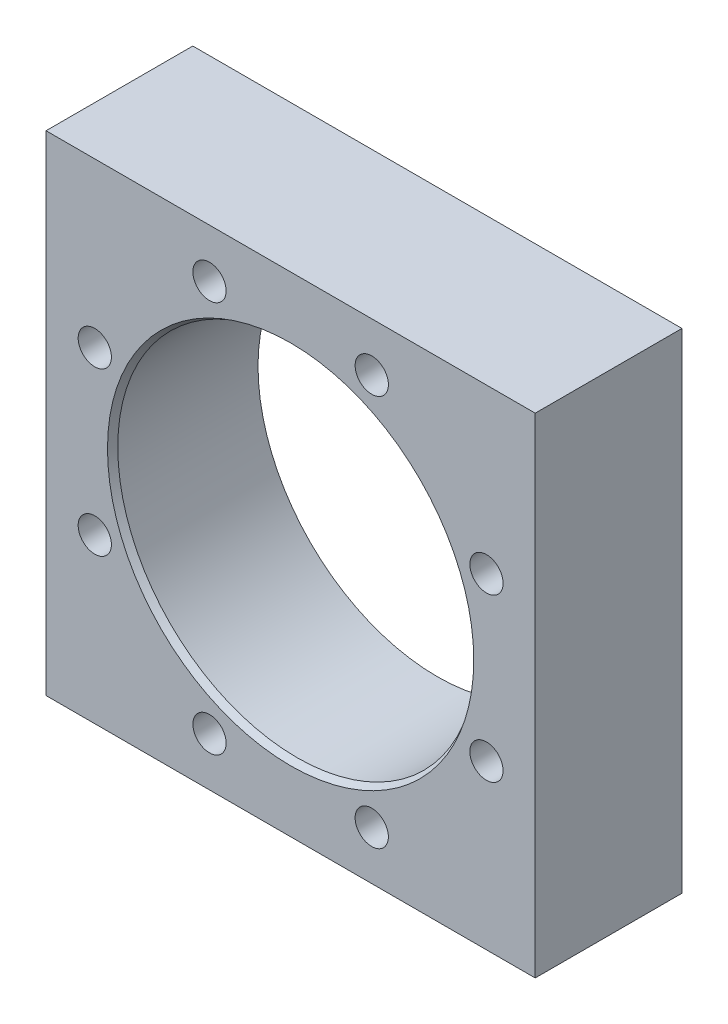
ISO-10303-21;
HEADER;
FILE_DESCRIPTION(('STEP AP214'),'2;1');
FILE_NAME('part.step','',(''),(''),'','','');
FILE_SCHEMA(('AUTOMOTIVE_DESIGN { 1 0 10303 214 1 1 1 1 }'));
ENDSEC;
DATA;
#1=APPLICATION_CONTEXT('core data for automotive mechanical design processes');
#2=APPLICATION_PROTOCOL_DEFINITION('international standard','automotive_design',2000,#1);
#3=PRODUCT_CONTEXT('',#1,'mechanical');
#4=PRODUCT('Part','Part','',(#3));
#5=PRODUCT_RELATED_PRODUCT_CATEGORY('part','',(#4));
#6=PRODUCT_DEFINITION_FORMATION('','',#4);
#7=PRODUCT_DEFINITION_CONTEXT('part definition',#1,'design');
#8=PRODUCT_DEFINITION('design','',#6,#7);
#9=PRODUCT_DEFINITION_SHAPE('','',#8);
#10=(LENGTH_UNIT() NAMED_UNIT(*) SI_UNIT(.MILLI.,.METRE.));
#11=(NAMED_UNIT(*) PLANE_ANGLE_UNIT() SI_UNIT($,.RADIAN.));
#12=(NAMED_UNIT(*) SI_UNIT($,.STERADIAN.) SOLID_ANGLE_UNIT());
#13=UNCERTAINTY_MEASURE_WITH_UNIT(LENGTH_MEASURE(1.E-05),#10,'distance_accuracy_value','');
#14=(GEOMETRIC_REPRESENTATION_CONTEXT(3) GLOBAL_UNCERTAINTY_ASSIGNED_CONTEXT((#13)) GLOBAL_UNIT_ASSIGNED_CONTEXT((#10,
#11,#12)) REPRESENTATION_CONTEXT('',''));
#15=CARTESIAN_POINT('',(0.,0.,0.));
#16=DIRECTION('',(0.,0.,1.));
#17=DIRECTION('',(1.,0.,0.));
#18=AXIS2_PLACEMENT_3D('',#15,#16,#17);
#19=CARTESIAN_POINT('',(0.,150.,45.));
#20=DIRECTION('',(0.,0.,-1.));
#21=DIRECTION('',(-1.,0.,0.));
#22=AXIS2_PLACEMENT_3D('',#19,#20,#21);
#23=PLANE('',#22);
#24=CARTESIAN_POINT('',(75.,75.,45.));
#25=DIRECTION('',(0.,0.,-1.));
#26=DIRECTION('',(-1.,0.,0.));
#27=AXIS2_PLACEMENT_3D('',#24,#25,#26);
#28=CIRCLE('',#27,56.1547005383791);
#29=CARTESIAN_POINT('',(18.8452994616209,75.,45.));
#30=VERTEX_POINT('',#29);
#31=EDGE_CURVE('E11',#30,#30,#28,.T.);
#32=ORIENTED_EDGE('',*,*,#31,.T.);
#33=EDGE_LOOP('',(#32));
#34=FACE_BOUND('',#33,.T.);
#35=CARTESIAN_POINT('',(50.1255768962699,135.052169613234,45.));
#36=DIRECTION('',(0.,0.,1.));
#37=DIRECTION('',(1.,0.,0.));
#38=AXIS2_PLACEMENT_3D('',#35,#36,#37);
#39=CIRCLE('',#38,5.09999999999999);
#40=CARTESIAN_POINT('',(55.2255768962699,135.052169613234,45.));
#41=VERTEX_POINT('',#40);
#42=EDGE_CURVE('E108',#41,#41,#39,.T.);
#43=ORIENTED_EDGE('',*,*,#42,.F.);
#44=EDGE_LOOP('',(#43));
#45=FACE_BOUND('',#44,.T.);
#46=CARTESIAN_POINT('',(14.9478303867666,99.8744231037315,45.));
#47=DIRECTION('',(0.,0.,1.));
#48=DIRECTION('',(1.,0.,0.));
#49=AXIS2_PLACEMENT_3D('',#46,#47,#48);
#50=CIRCLE('',#49,5.09999999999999);
#51=CARTESIAN_POINT('',(20.0478303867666,99.8744231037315,45.));
#52=VERTEX_POINT('',#51);
#53=EDGE_CURVE('E116',#52,#52,#50,.T.);
#54=ORIENTED_EDGE('',*,*,#53,.F.);
#55=EDGE_LOOP('',(#54));
#56=FACE_BOUND('',#55,.T.);
#57=CARTESIAN_POINT('',(14.9478303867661,50.1255768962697,45.));
#58=DIRECTION('',(0.,0.,1.));
#59=DIRECTION('',(1.,0.,0.));
#60=AXIS2_PLACEMENT_3D('',#57,#58,#59);
#61=CIRCLE('',#60,5.09999999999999);
#62=CARTESIAN_POINT('',(20.047830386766,50.1255768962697,45.));
#63=VERTEX_POINT('',#62);
#64=EDGE_CURVE('E122',#63,#63,#61,.T.);
#65=ORIENTED_EDGE('',*,*,#64,.F.);
#66=EDGE_LOOP('',(#65));
#67=FACE_BOUND('',#66,.T.);
#68=CARTESIAN_POINT('',(50.1255768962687,14.9478303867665,45.));
#69=DIRECTION('',(0.,0.,1.));
#70=DIRECTION('',(1.,0.,0.));
#71=AXIS2_PLACEMENT_3D('',#68,#69,#70);
#72=CIRCLE('',#71,5.09999999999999);
#73=CARTESIAN_POINT('',(55.2255768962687,14.9478303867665,45.));
#74=VERTEX_POINT('',#73);
#75=EDGE_CURVE('E128',#74,#74,#72,.T.);
#76=ORIENTED_EDGE('',*,*,#75,.F.);
#77=EDGE_LOOP('',(#76));
#78=FACE_BOUND('',#77,.T.);
#79=CARTESIAN_POINT('',(99.8744231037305,14.9478303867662,45.));
#80=DIRECTION('',(0.,0.,1.));
#81=DIRECTION('',(1.,0.,0.));
#82=AXIS2_PLACEMENT_3D('',#79,#80,#81);
#83=CIRCLE('',#82,5.09999999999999);
#84=CARTESIAN_POINT('',(104.97442310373,14.9478303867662,45.));
#85=VERTEX_POINT('',#84);
#86=EDGE_CURVE('E134',#85,#85,#83,.T.);
#87=ORIENTED_EDGE('',*,*,#86,.F.);
#88=EDGE_LOOP('',(#87));
#89=FACE_BOUND('',#88,.T.);
#90=CARTESIAN_POINT('',(135.052169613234,50.1255768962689,45.));
#91=DIRECTION('',(0.,0.,1.));
#92=DIRECTION('',(1.,0.,0.));
#93=AXIS2_PLACEMENT_3D('',#90,#91,#92);
#94=CIRCLE('',#93,5.09999999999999);
#95=CARTESIAN_POINT('',(140.152169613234,50.1255768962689,45.));
#96=VERTEX_POINT('',#95);
#97=EDGE_CURVE('E140',#96,#96,#94,.T.);
#98=ORIENTED_EDGE('',*,*,#97,.F.);
#99=EDGE_LOOP('',(#98));
#100=FACE_BOUND('',#99,.T.);
#101=CARTESIAN_POINT('',(135.052169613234,99.8744231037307,45.));
#102=DIRECTION('',(0.,0.,1.));
#103=DIRECTION('',(1.,0.,0.));
#104=AXIS2_PLACEMENT_3D('',#101,#102,#103);
#105=CIRCLE('',#104,5.09999999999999);
#106=CARTESIAN_POINT('',(140.152169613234,99.8744231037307,45.));
#107=VERTEX_POINT('',#106);
#108=EDGE_CURVE('E146',#107,#107,#105,.T.);
#109=ORIENTED_EDGE('',*,*,#108,.F.);
#110=EDGE_LOOP('',(#109));
#111=FACE_BOUND('',#110,.T.);
#112=CARTESIAN_POINT('',(99.8744231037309,135.052169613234,45.));
#113=DIRECTION('',(0.,0.,1.));
#114=DIRECTION('',(1.,0.,0.));
#115=AXIS2_PLACEMENT_3D('',#112,#113,#114);
#116=CIRCLE('',#115,5.09999999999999);
#117=CARTESIAN_POINT('',(104.974423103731,135.052169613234,45.));
#118=VERTEX_POINT('',#117);
#119=EDGE_CURVE('E152',#118,#118,#116,.T.);
#120=ORIENTED_EDGE('',*,*,#119,.F.);
#121=EDGE_LOOP('',(#120));
#122=FACE_BOUND('',#121,.T.);
#123=DIRECTION('',(0.,-1.,0.));
#124=VECTOR('',#123,1.);
#125=CARTESIAN_POINT('',(0.,0.,45.));
#126=LINE('',#125,#124);
#127=CARTESIAN_POINT('',(0.,150.,45.));
#128=VERTEX_POINT('',#127);
#129=CARTESIAN_POINT('',(0.,0.,45.));
#130=VERTEX_POINT('',#129);
#131=EDGE_CURVE('E167',#128,#130,#126,.T.);
#132=ORIENTED_EDGE('',*,*,#131,.T.);
#133=DIRECTION('',(1.,0.,0.));
#134=VECTOR('',#133,1.);
#135=CARTESIAN_POINT('',(0.,0.,45.));
#136=LINE('',#135,#134);
#137=CARTESIAN_POINT('',(150.,0.,45.));
#138=VERTEX_POINT('',#137);
#139=EDGE_CURVE('E169',#130,#138,#136,.T.);
#140=ORIENTED_EDGE('',*,*,#139,.T.);
#141=DIRECTION('',(0.,1.,0.));
#142=VECTOR('',#141,1.);
#143=CARTESIAN_POINT('',(150.,0.,45.));
#144=LINE('',#143,#142);
#145=CARTESIAN_POINT('',(150.,150.,45.));
#146=VERTEX_POINT('',#145);
#147=EDGE_CURVE('E55',#138,#146,#144,.T.);
#148=ORIENTED_EDGE('',*,*,#147,.T.);
#149=DIRECTION('',(-1.,0.,0.));
#150=VECTOR('',#149,1.);
#151=CARTESIAN_POINT('',(0.,150.,45.));
#152=LINE('',#151,#150);
#153=EDGE_CURVE('E50',#146,#128,#152,.T.);
#154=ORIENTED_EDGE('',*,*,#153,.T.);
#155=EDGE_LOOP('',(#132,#140,#148,#154));
#156=FACE_BOUND('',#155,.T.);
#157=ADVANCED_FACE('F35',(#34,#45,#56,#67,#78,#89,#100,#111,#122,#156),#23,.F.);
#158=CARTESIAN_POINT('',(0.,150.,0.));
#159=DIRECTION('',(0.,0.,-1.));
#160=DIRECTION('',(-1.,0.,0.));
#161=AXIS2_PLACEMENT_3D('',#158,#159,#160);
#162=PLANE('',#161);
#163=DIRECTION('',(0.,-1.,0.));
#164=VECTOR('',#163,1.);
#165=CARTESIAN_POINT('',(0.,0.,0.));
#166=LINE('',#165,#164);
#167=CARTESIAN_POINT('',(0.,150.,0.));
#168=VERTEX_POINT('',#167);
#169=CARTESIAN_POINT('',(0.,0.,0.));
#170=VERTEX_POINT('',#169);
#171=EDGE_CURVE('E158',#168,#170,#166,.T.);
#172=ORIENTED_EDGE('',*,*,#171,.F.);
#173=DIRECTION('',(-1.,0.,0.));
#174=VECTOR('',#173,1.);
#175=CARTESIAN_POINT('',(0.,150.,0.));
#176=LINE('',#175,#174);
#177=CARTESIAN_POINT('',(150.,150.,0.));
#178=VERTEX_POINT('',#177);
#179=EDGE_CURVE('E165',#178,#168,#176,.T.);
#180=ORIENTED_EDGE('',*,*,#179,.F.);
#181=DIRECTION('',(0.,1.,0.));
#182=VECTOR('',#181,1.);
#183=CARTESIAN_POINT('',(150.,0.,0.));
#184=LINE('',#183,#182);
#185=CARTESIAN_POINT('',(150.,0.,0.));
#186=VERTEX_POINT('',#185);
#187=EDGE_CURVE('E163',#186,#178,#184,.T.);
#188=ORIENTED_EDGE('',*,*,#187,.F.);
#189=DIRECTION('',(1.,0.,0.));
#190=VECTOR('',#189,1.);
#191=CARTESIAN_POINT('',(0.,0.,0.));
#192=LINE('',#191,#190);
#193=EDGE_CURVE('E161',#170,#186,#192,.T.);
#194=ORIENTED_EDGE('',*,*,#193,.F.);
#195=EDGE_LOOP('',(#172,#180,#188,#194));
#196=FACE_BOUND('',#195,.T.);
#197=CARTESIAN_POINT('',(75.,75.,0.));
#198=DIRECTION('',(0.,0.,1.));
#199=DIRECTION('',(1.,0.,0.));
#200=AXIS2_PLACEMENT_3D('',#197,#198,#199);
#201=CIRCLE('',#200,55.);
#202=CARTESIAN_POINT('',(20.,75.,0.));
#203=VERTEX_POINT('',#202);
#204=EDGE_CURVE('E155',#203,#203,#201,.T.);
#205=ORIENTED_EDGE('',*,*,#204,.T.);
#206=EDGE_LOOP('',(#205));
#207=FACE_BOUND('',#206,.T.);
#208=ADVANCED_FACE('F197',(#196,#207),#162,.T.);
#209=CARTESIAN_POINT('',(0.,0.,45.));
#210=DIRECTION('',(1.,0.,0.));
#211=DIRECTION('',(0.,0.,-1.));
#212=AXIS2_PLACEMENT_3D('',#209,#210,#211);
#213=PLANE('',#212);
#214=ORIENTED_EDGE('',*,*,#171,.T.);
#215=DIRECTION('',(0.,0.,-1.));
#216=VECTOR('',#215,1.);
#217=CARTESIAN_POINT('',(0.,0.,45.));
#218=LINE('',#217,#216);
#219=EDGE_CURVE('E182',#130,#170,#218,.T.);
#220=ORIENTED_EDGE('',*,*,#219,.F.);
#221=ORIENTED_EDGE('',*,*,#131,.F.);
#222=DIRECTION('',(0.,0.,-1.));
#223=VECTOR('',#222,1.);
#224=CARTESIAN_POINT('',(0.,150.,45.));
#225=LINE('',#224,#223);
#226=EDGE_CURVE('E173',#128,#168,#225,.T.);
#227=ORIENTED_EDGE('',*,*,#226,.T.);
#228=EDGE_LOOP('',(#214,#220,#221,#227));
#229=FACE_BOUND('',#228,.T.);
#230=ADVANCED_FACE('F37',(#229),#213,.F.);
#231=CARTESIAN_POINT('',(0.,0.,45.));
#232=DIRECTION('',(0.,1.,0.));
#233=DIRECTION('',(0.,0.,1.));
#234=AXIS2_PLACEMENT_3D('',#231,#232,#233);
#235=PLANE('',#234);
#236=ORIENTED_EDGE('',*,*,#193,.T.);
#237=DIRECTION('',(0.,0.,-1.));
#238=VECTOR('',#237,1.);
#239=CARTESIAN_POINT('',(150.,0.,45.));
#240=LINE('',#239,#238);
#241=EDGE_CURVE('E179',#138,#186,#240,.T.);
#242=ORIENTED_EDGE('',*,*,#241,.F.);
#243=ORIENTED_EDGE('',*,*,#139,.F.);
#244=ORIENTED_EDGE('',*,*,#219,.T.);
#245=EDGE_LOOP('',(#236,#242,#243,#244));
#246=FACE_BOUND('',#245,.T.);
#247=ADVANCED_FACE('F214',(#246),#235,.F.);
#248=CARTESIAN_POINT('',(150.,0.,45.));
#249=DIRECTION('',(-1.,0.,0.));
#250=DIRECTION('',(0.,0.,1.));
#251=AXIS2_PLACEMENT_3D('',#248,#249,#250);
#252=PLANE('',#251);
#253=ORIENTED_EDGE('',*,*,#187,.T.);
#254=DIRECTION('',(0.,0.,-1.));
#255=VECTOR('',#254,1.);
#256=CARTESIAN_POINT('',(150.,150.,45.));
#257=LINE('',#256,#255);
#258=EDGE_CURVE('E176',#146,#178,#257,.T.);
#259=ORIENTED_EDGE('',*,*,#258,.F.);
#260=ORIENTED_EDGE('',*,*,#147,.F.);
#261=ORIENTED_EDGE('',*,*,#241,.T.);
#262=EDGE_LOOP('',(#253,#259,#260,#261));
#263=FACE_BOUND('',#262,.T.);
#264=ADVANCED_FACE('F211',(#263),#252,.F.);
#265=CARTESIAN_POINT('',(0.,150.,45.));
#266=DIRECTION('',(0.,-1.,0.));
#267=DIRECTION('',(0.,0.,-1.));
#268=AXIS2_PLACEMENT_3D('',#265,#266,#267);
#269=PLANE('',#268);
#270=ORIENTED_EDGE('',*,*,#179,.T.);
#271=ORIENTED_EDGE('',*,*,#226,.F.);
#272=ORIENTED_EDGE('',*,*,#153,.F.);
#273=ORIENTED_EDGE('',*,*,#258,.T.);
#274=EDGE_LOOP('',(#270,#271,#272,#273));
#275=FACE_BOUND('',#274,.T.);
#276=ADVANCED_FACE('F208',(#275),#269,.F.);
#277=CARTESIAN_POINT('',(75.,75.,45.));
#278=DIRECTION('',(0.,0.,-1.));
#279=DIRECTION('',(-1.,0.,0.));
#280=AXIS2_PLACEMENT_3D('',#277,#278,#279);
#281=CYLINDRICAL_SURFACE('',#280,55.);
#282=CARTESIAN_POINT('',(75.,75.,43.0000000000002));
#283=DIRECTION('',(0.,0.,-1.));
#284=DIRECTION('',(-1.,0.,0.));
#285=AXIS2_PLACEMENT_3D('',#282,#283,#284);
#286=CIRCLE('',#285,55.);
#287=CARTESIAN_POINT('',(20.,75.,43.0000000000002));
#288=VERTEX_POINT('',#287);
#289=EDGE_CURVE('E43',#288,#288,#286,.F.);
#290=CARTESIAN_POINT('',(20.,75.,43.0000000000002));
#291=CARTESIAN_POINT('',(20.,75.,42.5520833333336));
#292=CARTESIAN_POINT('',(20.,75.,42.1041666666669));
#293=CARTESIAN_POINT('',(20.,75.,41.2083333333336));
#294=CARTESIAN_POINT('',(20.,75.,40.7604166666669));
#295=CARTESIAN_POINT('',(20.,75.,39.8645833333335));
#296=CARTESIAN_POINT('',(20.,75.,39.4166666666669));
#297=CARTESIAN_POINT('',(20.,75.,38.5208333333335));
#298=CARTESIAN_POINT('',(20.,75.,38.0729166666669));
#299=CARTESIAN_POINT('',(20.,75.,37.1770833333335));
#300=CARTESIAN_POINT('',(20.,75.,36.7291666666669));
#301=CARTESIAN_POINT('',(20.,75.,35.8333333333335));
#302=CARTESIAN_POINT('',(20.,75.,35.3854166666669));
#303=CARTESIAN_POINT('',(20.,75.,34.4895833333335));
#304=CARTESIAN_POINT('',(20.,75.,34.0416666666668));
#305=CARTESIAN_POINT('',(20.,75.,33.1458333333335));
#306=CARTESIAN_POINT('',(20.,75.,32.6979166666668));
#307=CARTESIAN_POINT('',(20.,75.,31.8020833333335));
#308=CARTESIAN_POINT('',(20.,75.,31.3541666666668));
#309=CARTESIAN_POINT('',(20.,75.,30.4583333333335));
#310=CARTESIAN_POINT('',(20.,75.,30.0104166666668));
#311=CARTESIAN_POINT('',(20.,75.,29.1145833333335));
#312=CARTESIAN_POINT('',(20.,75.,28.6666666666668));
#313=CARTESIAN_POINT('',(20.,75.,27.7708333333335));
#314=CARTESIAN_POINT('',(20.,75.,27.3229166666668));
#315=CARTESIAN_POINT('',(20.,75.,26.4270833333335));
#316=CARTESIAN_POINT('',(20.,75.,25.9791666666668));
#317=CARTESIAN_POINT('',(20.,75.,25.0833333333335));
#318=CARTESIAN_POINT('',(20.,75.,24.6354166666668));
#319=CARTESIAN_POINT('',(20.,75.,23.7395833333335));
#320=CARTESIAN_POINT('',(20.,75.,23.2916666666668));
#321=CARTESIAN_POINT('',(20.,75.,22.3958333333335));
#322=CARTESIAN_POINT('',(20.,75.,21.9479166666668));
#323=CARTESIAN_POINT('',(20.,75.,21.0520833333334));
#324=CARTESIAN_POINT('',(20.,75.,20.6041666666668));
#325=CARTESIAN_POINT('',(20.,75.,19.7083333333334));
#326=CARTESIAN_POINT('',(20.,75.,19.2604166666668));
#327=CARTESIAN_POINT('',(20.,75.,18.3645833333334));
#328=CARTESIAN_POINT('',(20.,75.,17.9166666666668));
#329=CARTESIAN_POINT('',(20.,75.,17.0208333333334));
#330=CARTESIAN_POINT('',(20.,75.,16.5729166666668));
#331=CARTESIAN_POINT('',(20.,75.,15.6770833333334));
#332=CARTESIAN_POINT('',(20.,75.,15.2291666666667));
#333=CARTESIAN_POINT('',(20.,75.,14.3333333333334));
#334=CARTESIAN_POINT('',(20.,75.,13.8854166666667));
#335=CARTESIAN_POINT('',(20.,75.,12.9895833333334));
#336=CARTESIAN_POINT('',(20.,75.,12.5416666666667));
#337=CARTESIAN_POINT('',(20.,75.,11.6458333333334));
#338=CARTESIAN_POINT('',(20.,75.,11.1979166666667));
#339=CARTESIAN_POINT('',(20.,75.,10.3020833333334));
#340=CARTESIAN_POINT('',(20.,75.,9.85416666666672));
#341=CARTESIAN_POINT('',(20.,75.,8.95833333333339));
#342=CARTESIAN_POINT('',(20.,75.,8.51041666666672));
#343=CARTESIAN_POINT('',(20.,75.,7.61458333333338));
#344=CARTESIAN_POINT('',(20.,75.,7.1666666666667));
#345=CARTESIAN_POINT('',(20.,75.,6.27083333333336));
#346=CARTESIAN_POINT('',(20.,75.,5.82291666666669));
#347=CARTESIAN_POINT('',(20.,75.,4.92708333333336));
#348=CARTESIAN_POINT('',(20.,75.,4.47916666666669));
#349=CARTESIAN_POINT('',(20.,75.,3.58333333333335));
#350=CARTESIAN_POINT('',(20.,75.,3.13541666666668));
#351=CARTESIAN_POINT('',(20.,75.,2.23958333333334));
#352=CARTESIAN_POINT('',(20.,75.,1.79166666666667));
#353=CARTESIAN_POINT('',(20.,75.,0.895833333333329));
#354=CARTESIAN_POINT('',(20.,75.,0.447916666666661));
#355=CARTESIAN_POINT('',(20.,75.,0.));
#356=B_SPLINE_CURVE_WITH_KNOTS('',3,(#290,#291,#292,#293,#294,#295,#296,#297,#298,#299,#300,
#301,#302,#303,#304,#305,#306,#307,#308,#309,#310,#311,#312,#313,#314,#315,#316,#317,#318,#319,
#320,#321,#322,#323,#324,#325,#326,#327,#328,#329,#330,#331,#332,#333,#334,#335,#336,#337,#338,
#339,#340,#341,#342,#343,#344,#345,#346,#347,#348,#349,#350,#351,#352,#353,#354,#355),
.UNSPECIFIED.,.F.,.F.,(4,2,2,2,2,2,2,2,2,2,2,2,2,2,2,2,2,2,2,2,2,2,2,2,2,2,2,2,2,2,2,2,4),(0.,
1.34375000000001,2.68750000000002,4.03125000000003,5.37500000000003,6.71875000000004,
8.06250000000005,9.40625000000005,10.7500000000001,12.0937500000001,13.4375000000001,
14.7812500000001,16.1250000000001,17.4687500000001,18.8125000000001,20.1562500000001,
21.5000000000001,22.8437500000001,24.1875000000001,25.5312500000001,26.8750000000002,
28.2187500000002,29.5625000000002,30.9062500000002,32.2500000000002,33.5937500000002,
34.9375000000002,36.2812500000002,37.6250000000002,38.9687500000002,40.3125000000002,
41.6562500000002,43.0000000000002),.UNSPECIFIED.);
#357=EDGE_CURVE('BSEAM187',#288,#203,#356,.T.);
#358=ORIENTED_EDGE('',*,*,#289,.T.);
#359=ORIENTED_EDGE('',*,*,#204,.F.);
#360=ORIENTED_EDGE('',*,*,#357,.T.);
#361=ORIENTED_EDGE('',*,*,#357,.F.);
#362=EDGE_LOOP('',(#358,#360,#359,#361));
#363=FACE_BOUND('',#362,.T.);
#364=ADVANCED_FACE('F187',(#363),#281,.F.);
#365=CARTESIAN_POINT('',(99.8744231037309,135.052169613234,45.));
#366=DIRECTION('',(0.,0.,1.));
#367=DIRECTION('',(1.,0.,0.));
#368=AXIS2_PLACEMENT_3D('',#365,#366,#367);
#369=CYLINDRICAL_SURFACE('',#368,5.09999999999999);
#370=CARTESIAN_POINT('',(99.8744231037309,135.052169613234,9.99999999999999));
#371=DIRECTION('',(0.,0.,1.));
#372=DIRECTION('',(1.,0.,0.));
#373=AXIS2_PLACEMENT_3D('',#370,#371,#372);
#374=CIRCLE('',#373,5.09999999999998);
#375=CARTESIAN_POINT('',(104.974423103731,135.052169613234,9.99999999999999));
#376=VERTEX_POINT('',#375);
#377=EDGE_CURVE('E149',#376,#376,#374,.T.);
#378=ORIENTED_EDGE('',*,*,#377,.F.);
#379=EDGE_LOOP('',(#378));
#380=FACE_BOUND('',#379,.T.);
#381=ORIENTED_EDGE('',*,*,#119,.T.);
#382=EDGE_LOOP('',(#381));
#383=FACE_BOUND('',#382,.T.);
#384=ADVANCED_FACE('F231',(#380,#383),#369,.F.);
#385=CARTESIAN_POINT('',(99.8744231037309,135.052169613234,9.99999999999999));
#386=DIRECTION('',(0.,0.,1.));
#387=DIRECTION('',(1.,0.,0.));
#388=AXIS2_PLACEMENT_3D('',#385,#386,#387);
#389=CONICAL_SURFACE('',#388,5.09999999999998,1.02974425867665);
#390=CARTESIAN_POINT('',(99.8744231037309,135.052169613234,6.93561084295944));
#391=VERTEX_POINT('',#390);
#392=VERTEX_LOOP('',#391);
#393=FACE_BOUND('',#392,.T.);
#394=ORIENTED_EDGE('',*,*,#377,.T.);
#395=EDGE_LOOP('',(#394));
#396=FACE_BOUND('',#395,.T.);
#397=ADVANCED_FACE('F235',(#393,#396),#389,.F.);
#398=CARTESIAN_POINT('',(135.052169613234,99.8744231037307,45.));
#399=DIRECTION('',(0.,0.,1.));
#400=DIRECTION('',(1.,0.,0.));
#401=AXIS2_PLACEMENT_3D('',#398,#399,#400);
#402=CYLINDRICAL_SURFACE('',#401,5.09999999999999);
#403=CARTESIAN_POINT('',(135.052169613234,99.8744231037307,9.99999999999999));
#404=DIRECTION('',(0.,0.,1.));
#405=DIRECTION('',(1.,0.,0.));
#406=AXIS2_PLACEMENT_3D('',#403,#404,#405);
#407=CIRCLE('',#406,5.09999999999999);
#408=CARTESIAN_POINT('',(140.152169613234,99.8744231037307,9.99999999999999));
#409=VERTEX_POINT('',#408);
#410=EDGE_CURVE('E143',#409,#409,#407,.T.);
#411=ORIENTED_EDGE('',*,*,#410,.F.);
#412=EDGE_LOOP('',(#411));
#413=FACE_BOUND('',#412,.T.);
#414=ORIENTED_EDGE('',*,*,#108,.T.);
#415=EDGE_LOOP('',(#414));
#416=FACE_BOUND('',#415,.T.);
#417=ADVANCED_FACE('F241',(#413,#416),#402,.F.);
#418=CARTESIAN_POINT('',(135.052169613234,99.8744231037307,9.99999999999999));
#419=DIRECTION('',(0.,0.,1.));
#420=DIRECTION('',(1.,0.,0.));
#421=AXIS2_PLACEMENT_3D('',#418,#419,#420);
#422=CONICAL_SURFACE('',#421,5.09999999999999,1.02974425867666);
#423=CARTESIAN_POINT('',(135.052169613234,99.8744231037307,6.93561084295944));
#424=VERTEX_POINT('',#423);
#425=VERTEX_LOOP('',#424);
#426=FACE_BOUND('',#425,.T.);
#427=ORIENTED_EDGE('',*,*,#410,.T.);
#428=EDGE_LOOP('',(#427));
#429=FACE_BOUND('',#428,.T.);
#430=ADVANCED_FACE('F245',(#426,#429),#422,.F.);
#431=CARTESIAN_POINT('',(135.052169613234,50.1255768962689,45.));
#432=DIRECTION('',(0.,0.,1.));
#433=DIRECTION('',(1.,0.,0.));
#434=AXIS2_PLACEMENT_3D('',#431,#432,#433);
#435=CYLINDRICAL_SURFACE('',#434,5.09999999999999);
#436=CARTESIAN_POINT('',(135.052169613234,50.1255768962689,9.99999999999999));
#437=DIRECTION('',(0.,0.,1.));
#438=DIRECTION('',(1.,0.,0.));
#439=AXIS2_PLACEMENT_3D('',#436,#437,#438);
#440=CIRCLE('',#439,5.09999999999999);
#441=CARTESIAN_POINT('',(140.152169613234,50.1255768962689,9.99999999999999));
#442=VERTEX_POINT('',#441);
#443=EDGE_CURVE('E137',#442,#442,#440,.T.);
#444=ORIENTED_EDGE('',*,*,#443,.F.);
#445=EDGE_LOOP('',(#444));
#446=FACE_BOUND('',#445,.T.);
#447=ORIENTED_EDGE('',*,*,#97,.T.);
#448=EDGE_LOOP('',(#447));
#449=FACE_BOUND('',#448,.T.);
#450=ADVANCED_FACE('F249',(#446,#449),#435,.F.);
#451=CARTESIAN_POINT('',(135.052169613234,50.1255768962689,9.99999999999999));
#452=DIRECTION('',(0.,0.,1.));
#453=DIRECTION('',(1.,0.,0.));
#454=AXIS2_PLACEMENT_3D('',#451,#452,#453);
#455=CONICAL_SURFACE('',#454,5.09999999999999,1.02974425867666);
#456=CARTESIAN_POINT('',(135.052169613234,50.1255768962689,6.93561084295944));
#457=VERTEX_POINT('',#456);
#458=VERTEX_LOOP('',#457);
#459=FACE_BOUND('',#458,.T.);
#460=ORIENTED_EDGE('',*,*,#443,.T.);
#461=EDGE_LOOP('',(#460));
#462=FACE_BOUND('',#461,.T.);
#463=ADVANCED_FACE('F253',(#459,#462),#455,.F.);
#464=CARTESIAN_POINT('',(99.8744231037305,14.9478303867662,45.));
#465=DIRECTION('',(0.,0.,1.));
#466=DIRECTION('',(1.,0.,0.));
#467=AXIS2_PLACEMENT_3D('',#464,#465,#466);
#468=CYLINDRICAL_SURFACE('',#467,5.09999999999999);
#469=CARTESIAN_POINT('',(99.8744231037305,14.9478303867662,9.99999999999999));
#470=DIRECTION('',(0.,0.,1.));
#471=DIRECTION('',(1.,0.,0.));
#472=AXIS2_PLACEMENT_3D('',#469,#470,#471);
#473=CIRCLE('',#472,5.09999999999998);
#474=CARTESIAN_POINT('',(104.97442310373,14.9478303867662,9.99999999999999));
#475=VERTEX_POINT('',#474);
#476=EDGE_CURVE('E131',#475,#475,#473,.T.);
#477=ORIENTED_EDGE('',*,*,#476,.F.);
#478=EDGE_LOOP('',(#477));
#479=FACE_BOUND('',#478,.T.);
#480=ORIENTED_EDGE('',*,*,#86,.T.);
#481=EDGE_LOOP('',(#480));
#482=FACE_BOUND('',#481,.T.);
#483=ADVANCED_FACE('F257',(#479,#482),#468,.F.);
#484=CARTESIAN_POINT('',(99.8744231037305,14.9478303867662,9.99999999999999));
#485=DIRECTION('',(0.,0.,1.));
#486=DIRECTION('',(1.,0.,0.));
#487=AXIS2_PLACEMENT_3D('',#484,#485,#486);
#488=CONICAL_SURFACE('',#487,5.09999999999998,1.02974425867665);
#489=CARTESIAN_POINT('',(99.8744231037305,14.9478303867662,6.93561084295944));
#490=VERTEX_POINT('',#489);
#491=VERTEX_LOOP('',#490);
#492=FACE_BOUND('',#491,.T.);
#493=ORIENTED_EDGE('',*,*,#476,.T.);
#494=EDGE_LOOP('',(#493));
#495=FACE_BOUND('',#494,.T.);
#496=ADVANCED_FACE('F261',(#492,#495),#488,.F.);
#497=CARTESIAN_POINT('',(50.1255768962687,14.9478303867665,45.));
#498=DIRECTION('',(0.,0.,1.));
#499=DIRECTION('',(1.,0.,0.));
#500=AXIS2_PLACEMENT_3D('',#497,#498,#499);
#501=CYLINDRICAL_SURFACE('',#500,5.09999999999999);
#502=CARTESIAN_POINT('',(50.1255768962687,14.9478303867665,9.99999999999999));
#503=DIRECTION('',(0.,0.,1.));
#504=DIRECTION('',(1.,0.,0.));
#505=AXIS2_PLACEMENT_3D('',#502,#503,#504);
#506=CIRCLE('',#505,5.09999999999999);
#507=CARTESIAN_POINT('',(55.2255768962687,14.9478303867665,9.99999999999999));
#508=VERTEX_POINT('',#507);
#509=EDGE_CURVE('E125',#508,#508,#506,.T.);
#510=ORIENTED_EDGE('',*,*,#509,.F.);
#511=EDGE_LOOP('',(#510));
#512=FACE_BOUND('',#511,.T.);
#513=ORIENTED_EDGE('',*,*,#75,.T.);
#514=EDGE_LOOP('',(#513));
#515=FACE_BOUND('',#514,.T.);
#516=ADVANCED_FACE('F265',(#512,#515),#501,.F.);
#517=CARTESIAN_POINT('',(50.1255768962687,14.9478303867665,9.99999999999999));
#518=DIRECTION('',(0.,0.,1.));
#519=DIRECTION('',(1.,0.,0.));
#520=AXIS2_PLACEMENT_3D('',#517,#518,#519);
#521=CONICAL_SURFACE('',#520,5.09999999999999,1.02974425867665);
#522=CARTESIAN_POINT('',(50.1255768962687,14.9478303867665,6.93561084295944));
#523=VERTEX_POINT('',#522);
#524=VERTEX_LOOP('',#523);
#525=FACE_BOUND('',#524,.T.);
#526=ORIENTED_EDGE('',*,*,#509,.T.);
#527=EDGE_LOOP('',(#526));
#528=FACE_BOUND('',#527,.T.);
#529=ADVANCED_FACE('F269',(#525,#528),#521,.F.);
#530=CARTESIAN_POINT('',(14.9478303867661,50.1255768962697,45.));
#531=DIRECTION('',(0.,0.,1.));
#532=DIRECTION('',(1.,0.,0.));
#533=AXIS2_PLACEMENT_3D('',#530,#531,#532);
#534=CYLINDRICAL_SURFACE('',#533,5.09999999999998);
#535=CARTESIAN_POINT('',(14.9478303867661,50.1255768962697,9.99999999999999));
#536=DIRECTION('',(0.,0.,1.));
#537=DIRECTION('',(1.,0.,0.));
#538=AXIS2_PLACEMENT_3D('',#535,#536,#537);
#539=CIRCLE('',#538,5.09999999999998);
#540=CARTESIAN_POINT('',(20.047830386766,50.1255768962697,9.99999999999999));
#541=VERTEX_POINT('',#540);
#542=EDGE_CURVE('E119',#541,#541,#539,.T.);
#543=ORIENTED_EDGE('',*,*,#542,.F.);
#544=EDGE_LOOP('',(#543));
#545=FACE_BOUND('',#544,.T.);
#546=ORIENTED_EDGE('',*,*,#64,.T.);
#547=EDGE_LOOP('',(#546));
#548=FACE_BOUND('',#547,.T.);
#549=ADVANCED_FACE('F273',(#545,#548),#534,.F.);
#550=CARTESIAN_POINT('',(14.9478303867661,50.1255768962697,9.99999999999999));
#551=DIRECTION('',(0.,0.,1.));
#552=DIRECTION('',(1.,0.,0.));
#553=AXIS2_PLACEMENT_3D('',#550,#551,#552);
#554=CONICAL_SURFACE('',#553,5.09999999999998,1.02974425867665);
#555=CARTESIAN_POINT('',(14.9478303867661,50.1255768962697,6.93561084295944));
#556=VERTEX_POINT('',#555);
#557=VERTEX_LOOP('',#556);
#558=FACE_BOUND('',#557,.T.);
#559=ORIENTED_EDGE('',*,*,#542,.T.);
#560=EDGE_LOOP('',(#559));
#561=FACE_BOUND('',#560,.T.);
#562=ADVANCED_FACE('F277',(#558,#561),#554,.F.);
#563=CARTESIAN_POINT('',(14.9478303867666,99.8744231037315,45.));
#564=DIRECTION('',(0.,0.,1.));
#565=DIRECTION('',(1.,0.,0.));
#566=AXIS2_PLACEMENT_3D('',#563,#564,#565);
#567=CYLINDRICAL_SURFACE('',#566,5.09999999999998);
#568=CARTESIAN_POINT('',(14.9478303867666,99.8744231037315,9.99999999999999));
#569=DIRECTION('',(0.,0.,1.));
#570=DIRECTION('',(1.,0.,0.));
#571=AXIS2_PLACEMENT_3D('',#568,#569,#570);
#572=CIRCLE('',#571,5.09999999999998);
#573=CARTESIAN_POINT('',(20.0478303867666,99.8744231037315,9.99999999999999));
#574=VERTEX_POINT('',#573);
#575=EDGE_CURVE('E111',#574,#574,#572,.T.);
#576=ORIENTED_EDGE('',*,*,#575,.F.);
#577=EDGE_LOOP('',(#576));
#578=FACE_BOUND('',#577,.T.);
#579=ORIENTED_EDGE('',*,*,#53,.T.);
#580=EDGE_LOOP('',(#579));
#581=FACE_BOUND('',#580,.T.);
#582=ADVANCED_FACE('F281',(#578,#581),#567,.F.);
#583=CARTESIAN_POINT('',(14.9478303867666,99.8744231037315,9.99999999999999));
#584=DIRECTION('',(0.,0.,1.));
#585=DIRECTION('',(1.,0.,0.));
#586=AXIS2_PLACEMENT_3D('',#583,#584,#585);
#587=CONICAL_SURFACE('',#586,5.09999999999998,1.02974425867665);
#588=CARTESIAN_POINT('',(14.9478303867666,99.8744231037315,6.93561084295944));
#589=VERTEX_POINT('',#588);
#590=VERTEX_LOOP('',#589);
#591=FACE_BOUND('',#590,.T.);
#592=ORIENTED_EDGE('',*,*,#575,.T.);
#593=EDGE_LOOP('',(#592));
#594=FACE_BOUND('',#593,.T.);
#595=ADVANCED_FACE('F285',(#591,#594),#587,.F.);
#596=CARTESIAN_POINT('',(50.1255768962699,135.052169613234,45.));
#597=DIRECTION('',(0.,0.,1.));
#598=DIRECTION('',(1.,0.,0.));
#599=AXIS2_PLACEMENT_3D('',#596,#597,#598);
#600=CYLINDRICAL_SURFACE('',#599,5.09999999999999);
#601=CARTESIAN_POINT('',(50.1255768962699,135.052169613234,9.99999999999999));
#602=DIRECTION('',(0.,0.,1.));
#603=DIRECTION('',(1.,0.,0.));
#604=AXIS2_PLACEMENT_3D('',#601,#602,#603);
#605=CIRCLE('',#604,5.09999999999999);
#606=CARTESIAN_POINT('',(55.2255768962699,135.052169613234,9.99999999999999));
#607=VERTEX_POINT('',#606);
#608=EDGE_CURVE('E106',#607,#607,#605,.T.);
#609=ORIENTED_EDGE('',*,*,#608,.F.);
#610=EDGE_LOOP('',(#609));
#611=FACE_BOUND('',#610,.T.);
#612=ORIENTED_EDGE('',*,*,#42,.T.);
#613=EDGE_LOOP('',(#612));
#614=FACE_BOUND('',#613,.T.);
#615=ADVANCED_FACE('F102',(#611,#614),#600,.F.);
#616=CARTESIAN_POINT('',(50.1255768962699,135.052169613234,9.99999999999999));
#617=DIRECTION('',(0.,0.,1.));
#618=DIRECTION('',(1.,0.,0.));
#619=AXIS2_PLACEMENT_3D('',#616,#617,#618);
#620=CONICAL_SURFACE('',#619,5.09999999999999,1.02974425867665);
#621=CARTESIAN_POINT('',(50.1255768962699,135.052169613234,6.93561084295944));
#622=VERTEX_POINT('',#621);
#623=VERTEX_LOOP('',#622);
#624=FACE_BOUND('',#623,.T.);
#625=ORIENTED_EDGE('',*,*,#608,.T.);
#626=EDGE_LOOP('',(#625));
#627=FACE_BOUND('',#626,.T.);
#628=ADVANCED_FACE('F98',(#624,#627),#620,.F.);
#629=CARTESIAN_POINT('',(75.,75.,43.0000000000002));
#630=DIRECTION('',(0.,0.,1.));
#631=DIRECTION('',(1.,0.,0.));
#632=AXIS2_PLACEMENT_3D('',#629,#630,#631);
#633=CONICAL_SURFACE('',#632,55.,0.523598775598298);
#634=ORIENTED_EDGE('',*,*,#31,.F.);
#635=EDGE_LOOP('',(#634));
#636=FACE_BOUND('',#635,.T.);
#637=ORIENTED_EDGE('',*,*,#289,.F.);
#638=EDGE_LOOP('',(#637));
#639=FACE_BOUND('',#638,.T.);
#640=ADVANCED_FACE('F101',(#636,#639),#633,.F.);
#641=CLOSED_SHELL('',(#157,#208,#230,#247,#264,#276,#364,#384,#397,#417,#430,#450,#463,#483,
#496,#516,#529,#549,#562,#582,#595,#615,#628,#640));
#642=MANIFOLD_SOLID_BREP('B2',#641);
#643=ADVANCED_BREP_SHAPE_REPRESENTATION('',(#18,#642),#14);
#644=SHAPE_DEFINITION_REPRESENTATION(#9,#643);
ENDSEC;
END-ISO-10303-21;
